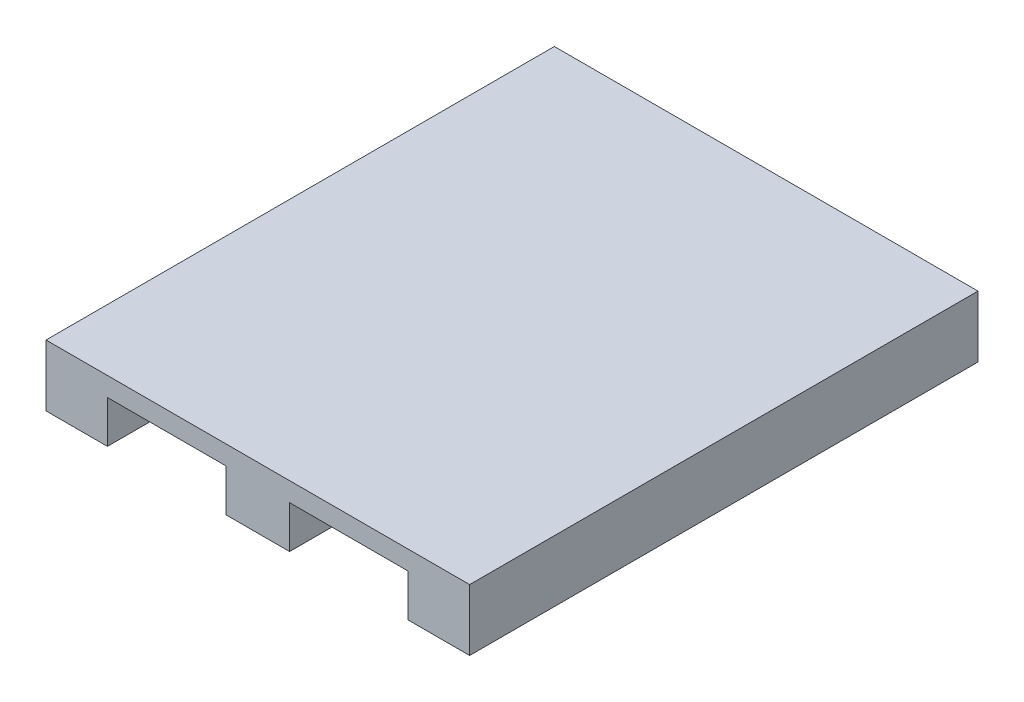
from build123d import *

# Parameters (mm, degrees)
LINEAR_AUSTRAGEN1_DEPTH = 1200


with BuildPart() as part:
    # Skizze1 → Linear austragen1 (new body)
    with BuildSketch(Plane.XY):
        Polygon((-355, 0), (-355, 100), (-75, 100), (-75, 0), (75, 0), (75, 100), (355, 100), (355, 0), (500, 0), (500, 145), (-500, 145), (-500, 0), align=None)
    extrude(amount=-LINEAR_AUSTRAGEN1_DEPTH)


solid = part.part
